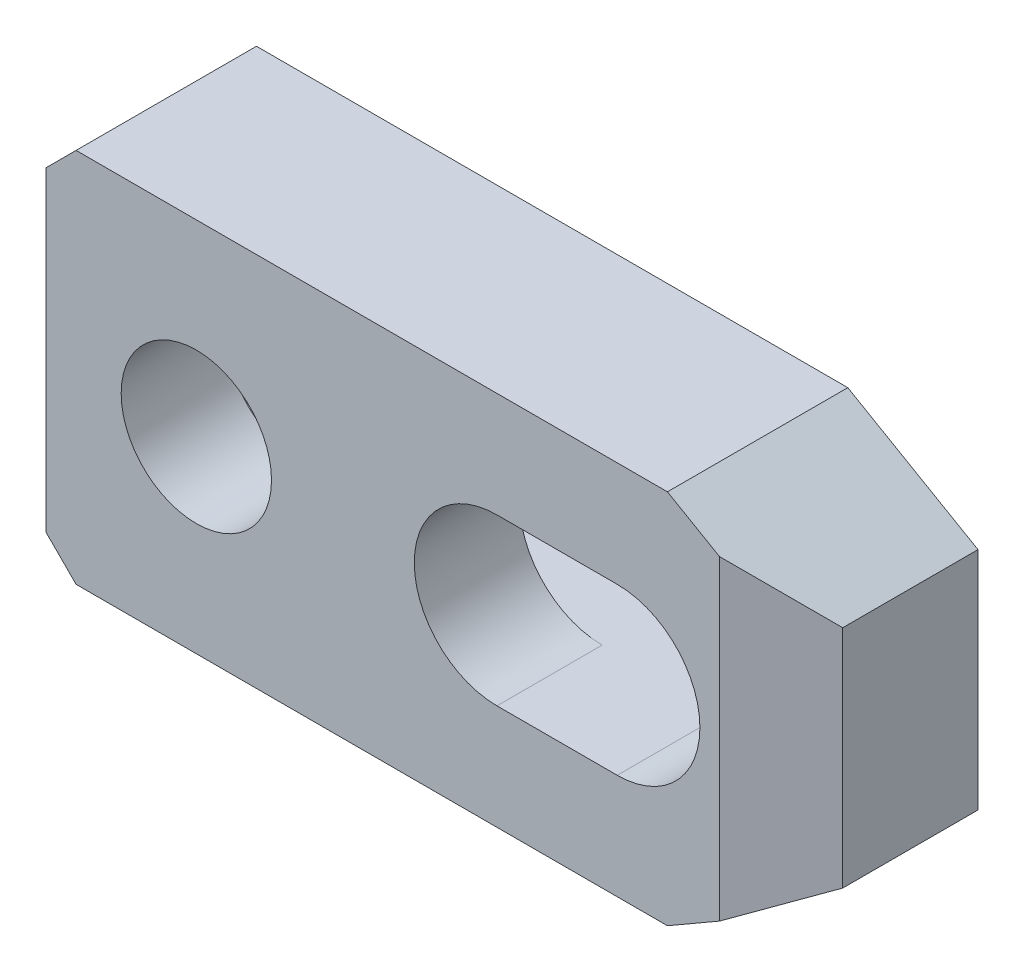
ISO-10303-21;
HEADER;
FILE_DESCRIPTION(('STEP AP214'),'2;1');
FILE_NAME('part.step','',(''),(''),'','','');
FILE_SCHEMA(('AUTOMOTIVE_DESIGN { 1 0 10303 214 1 1 1 1 }'));
ENDSEC;
DATA;
#1=APPLICATION_CONTEXT('core data for automotive mechanical design processes');
#2=APPLICATION_PROTOCOL_DEFINITION('international standard','automotive_design',2000,#1);
#3=PRODUCT_CONTEXT('',#1,'mechanical');
#4=PRODUCT('Part','Part','',(#3));
#5=PRODUCT_RELATED_PRODUCT_CATEGORY('part','',(#4));
#6=PRODUCT_DEFINITION_FORMATION('','',#4);
#7=PRODUCT_DEFINITION_CONTEXT('part definition',#1,'design');
#8=PRODUCT_DEFINITION('design','',#6,#7);
#9=PRODUCT_DEFINITION_SHAPE('','',#8);
#10=(LENGTH_UNIT() NAMED_UNIT(*) SI_UNIT(.MILLI.,.METRE.));
#11=(NAMED_UNIT(*) PLANE_ANGLE_UNIT() SI_UNIT($,.RADIAN.));
#12=(NAMED_UNIT(*) SI_UNIT($,.STERADIAN.) SOLID_ANGLE_UNIT());
#13=UNCERTAINTY_MEASURE_WITH_UNIT(LENGTH_MEASURE(1.E-05),#10,'distance_accuracy_value','');
#14=(GEOMETRIC_REPRESENTATION_CONTEXT(3) GLOBAL_UNCERTAINTY_ASSIGNED_CONTEXT((#13)) GLOBAL_UNIT_ASSIGNED_CONTEXT((#10,
#11,#12)) REPRESENTATION_CONTEXT('',''));
#15=CARTESIAN_POINT('',(0.,0.,0.));
#16=DIRECTION('',(0.,0.,1.));
#17=DIRECTION('',(1.,0.,0.));
#18=AXIS2_PLACEMENT_3D('',#15,#16,#17);
#19=CARTESIAN_POINT('',(-21.6006535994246,26.8993464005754,0.));
#20=DIRECTION('',(0.,0.,1.));
#21=DIRECTION('',(-1.,0.,0.));
#22=AXIS2_PLACEMENT_3D('',#19,#20,#21);
#23=PLANE('',#22);
#24=DIRECTION('',(0.,1.,0.));
#25=VECTOR('',#24,1.);
#26=CARTESIAN_POINT('',(-38.,-10.5,0.));
#27=LINE('',#26,#25);
#28=CARTESIAN_POINT('',(-38.,-10.5,0.));
#29=VERTEX_POINT('',#28);
#30=CARTESIAN_POINT('',(-38.,-5.5,0.));
#31=VERTEX_POINT('',#30);
#32=EDGE_CURVE('E174',#29,#31,#27,.T.);
#33=ORIENTED_EDGE('',*,*,#32,.T.);
#34=DIRECTION('',(-1.,0.,0.));
#35=VECTOR('',#34,1.);
#36=CARTESIAN_POINT('',(0.,-5.5,0.));
#37=LINE('',#36,#35);
#38=CARTESIAN_POINT('',(0.,-5.5,0.));
#39=VERTEX_POINT('',#38);
#40=EDGE_CURVE('E265',#39,#31,#37,.T.);
#41=ORIENTED_EDGE('',*,*,#40,.F.);
#42=CARTESIAN_POINT('',(0.,0.,0.));
#43=DIRECTION('',(0.,0.,1.));
#44=DIRECTION('',(-1.,0.,0.));
#45=AXIS2_PLACEMENT_3D('',#42,#43,#44);
#46=CIRCLE('',#45,5.5);
#47=CARTESIAN_POINT('',(0.,5.5,0.));
#48=VERTEX_POINT('',#47);
#49=EDGE_CURVE('E267',#39,#48,#46,.T.);
#50=ORIENTED_EDGE('',*,*,#49,.T.);
#51=DIRECTION('',(1.,0.,0.));
#52=VECTOR('',#51,1.);
#53=CARTESIAN_POINT('',(-8.,5.5,0.));
#54=LINE('',#53,#52);
#55=CARTESIAN_POINT('',(-38.,5.5,0.));
#56=VERTEX_POINT('',#55);
#57=EDGE_CURVE('E229',#56,#48,#54,.T.);
#58=ORIENTED_EDGE('',*,*,#57,.F.);
#59=CARTESIAN_POINT('',(-38.,10.5,0.));
#60=VERTEX_POINT('',#59);
#61=EDGE_CURVE('E177',#56,#60,#27,.T.);
#62=ORIENTED_EDGE('',*,*,#61,.T.);
#63=DIRECTION('',(-0.707106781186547,-0.707106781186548,0.));
#64=VECTOR('',#63,1.);
#65=CARTESIAN_POINT('',(-36.,12.5,0.));
#66=LINE('',#65,#64);
#67=CARTESIAN_POINT('',(-36.,12.5,0.));
#68=VERTEX_POINT('',#67);
#69=EDGE_CURVE('E178',#68,#60,#66,.T.);
#70=ORIENTED_EDGE('',*,*,#69,.F.);
#71=DIRECTION('',(-1.,0.,0.));
#72=VECTOR('',#71,1.);
#73=CARTESIAN_POINT('',(3.3397459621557,12.5,0.));
#74=LINE('',#73,#72);
#75=CARTESIAN_POINT('',(3.3397459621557,12.5,0.));
#76=VERTEX_POINT('',#75);
#77=EDGE_CURVE('E181',#76,#68,#74,.T.);
#78=ORIENTED_EDGE('',*,*,#77,.F.);
#79=DIRECTION('',(-0.866025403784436,0.5,0.));
#80=VECTOR('',#79,1.);
#81=CARTESIAN_POINT('',(12.,7.5,0.));
#82=LINE('',#81,#80);
#83=CARTESIAN_POINT('',(12.,7.5,0.));
#84=VERTEX_POINT('',#83);
#85=EDGE_CURVE('E160',#84,#76,#82,.T.);
#86=ORIENTED_EDGE('',*,*,#85,.F.);
#87=DIRECTION('',(0.,-1.,0.));
#88=VECTOR('',#87,1.);
#89=CARTESIAN_POINT('',(12.,7.5,0.));
#90=LINE('',#89,#88);
#91=CARTESIAN_POINT('',(12.,-7.5,0.));
#92=VERTEX_POINT('',#91);
#93=EDGE_CURVE('E161',#84,#92,#90,.T.);
#94=ORIENTED_EDGE('',*,*,#93,.T.);
#95=DIRECTION('',(-0.86602540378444,-0.5,0.));
#96=VECTOR('',#95,1.);
#97=CARTESIAN_POINT('',(12.,-7.5,0.));
#98=LINE('',#97,#96);
#99=CARTESIAN_POINT('',(3.33974596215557,-12.5,0.));
#100=VERTEX_POINT('',#99);
#101=EDGE_CURVE('E165',#92,#100,#98,.T.);
#102=ORIENTED_EDGE('',*,*,#101,.T.);
#103=DIRECTION('',(-1.,0.,0.));
#104=VECTOR('',#103,1.);
#105=CARTESIAN_POINT('',(3.33974596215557,-12.5,0.));
#106=LINE('',#105,#104);
#107=CARTESIAN_POINT('',(-36.,-12.5,0.));
#108=VERTEX_POINT('',#107);
#109=EDGE_CURVE('E168',#100,#108,#106,.T.);
#110=ORIENTED_EDGE('',*,*,#109,.T.);
#111=DIRECTION('',(-0.707106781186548,0.707106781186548,0.));
#112=VECTOR('',#111,1.);
#113=CARTESIAN_POINT('',(-36.,-12.5,0.));
#114=LINE('',#113,#112);
#115=EDGE_CURVE('E171',#108,#29,#114,.T.);
#116=ORIENTED_EDGE('',*,*,#115,.T.);
#117=EDGE_LOOP('',(#33,#41,#50,#58,#62,#70,#78,#86,#94,#102,#110,#116));
#118=FACE_BOUND('',#117,.T.);
#119=ADVANCED_FACE('F14',(#118),#23,.F.);
#120=CARTESIAN_POINT('',(-38.,-10.5,12.));
#121=DIRECTION('',(-1.,0.,0.));
#122=DIRECTION('',(0.,0.,-1.));
#123=AXIS2_PLACEMENT_3D('',#120,#121,#122);
#124=PLANE('',#123);
#125=DIRECTION('',(0.,-1.,0.));
#126=VECTOR('',#125,1.);
#127=CARTESIAN_POINT('',(-38.,-10.5,5.));
#128=LINE('',#127,#126);
#129=CARTESIAN_POINT('',(-38.,5.5,5.));
#130=VERTEX_POINT('',#129);
#131=CARTESIAN_POINT('',(-38.,-5.5,5.));
#132=VERTEX_POINT('',#131);
#133=EDGE_CURVE('E126',#130,#132,#128,.T.);
#134=ORIENTED_EDGE('',*,*,#133,.T.);
#135=DIRECTION('',(0.,0.,-1.));
#136=VECTOR('',#135,1.);
#137=CARTESIAN_POINT('',(-38.,-5.5,12.));
#138=LINE('',#137,#136);
#139=EDGE_CURVE('E263',#132,#31,#138,.T.);
#140=ORIENTED_EDGE('',*,*,#139,.T.);
#141=ORIENTED_EDGE('',*,*,#32,.F.);
#142=DIRECTION('',(0.,0.,-1.));
#143=VECTOR('',#142,1.);
#144=CARTESIAN_POINT('',(-38.,-10.5,12.));
#145=LINE('',#144,#143);
#146=CARTESIAN_POINT('',(-38.,-10.5,12.));
#147=VERTEX_POINT('',#146);
#148=EDGE_CURVE('E212',#147,#29,#145,.T.);
#149=ORIENTED_EDGE('',*,*,#148,.F.);
#150=DIRECTION('',(0.,1.,0.));
#151=VECTOR('',#150,1.);
#152=CARTESIAN_POINT('',(-38.,-10.5,12.));
#153=LINE('',#152,#151);
#154=CARTESIAN_POINT('',(-38.,10.5,12.));
#155=VERTEX_POINT('',#154);
#156=EDGE_CURVE('E195',#147,#155,#153,.T.);
#157=ORIENTED_EDGE('',*,*,#156,.T.);
#158=DIRECTION('',(0.,0.,-1.));
#159=VECTOR('',#158,1.);
#160=CARTESIAN_POINT('',(-38.,10.5,12.));
#161=LINE('',#160,#159);
#162=EDGE_CURVE('E214',#155,#60,#161,.T.);
#163=ORIENTED_EDGE('',*,*,#162,.T.);
#164=ORIENTED_EDGE('',*,*,#61,.F.);
#165=DIRECTION('',(0.,0.,-1.));
#166=VECTOR('',#165,1.);
#167=CARTESIAN_POINT('',(-38.,5.5,12.));
#168=LINE('',#167,#166);
#169=EDGE_CURVE('E284',#130,#56,#168,.T.);
#170=ORIENTED_EDGE('',*,*,#169,.F.);
#171=EDGE_LOOP('',(#134,#140,#141,#149,#157,#163,#164,#170));
#172=FACE_BOUND('',#171,.T.);
#173=ADVANCED_FACE('F231',(#172),#124,.T.);
#174=CARTESIAN_POINT('',(-28.,0.,12.));
#175=DIRECTION('',(0.,0.,-1.));
#176=DIRECTION('',(1.,0.,0.));
#177=AXIS2_PLACEMENT_3D('',#174,#175,#176);
#178=CYLINDRICAL_SURFACE('',#177,5.);
#179=CARTESIAN_POINT('',(-28.,0.,12.));
#180=DIRECTION('',(0.,0.,1.));
#181=DIRECTION('',(-1.,0.,0.));
#182=AXIS2_PLACEMENT_3D('',#179,#180,#181);
#183=CIRCLE('',#182,5.);
#184=CARTESIAN_POINT('',(-33.,0.,12.));
#185=VERTEX_POINT('',#184);
#186=EDGE_CURVE('E157',#185,#185,#183,.T.);
#187=ORIENTED_EDGE('',*,*,#186,.T.);
#188=EDGE_LOOP('',(#187));
#189=FACE_BOUND('',#188,.T.);
#190=CARTESIAN_POINT('',(-28.,0.,5.));
#191=DIRECTION('',(0.,0.,-1.));
#192=DIRECTION('',(1.,0.,0.));
#193=AXIS2_PLACEMENT_3D('',#190,#191,#192);
#194=CIRCLE('',#193,5.);
#195=CARTESIAN_POINT('',(-23.,0.,5.));
#196=VERTEX_POINT('',#195);
#197=EDGE_CURVE('E140',#196,#196,#194,.T.);
#198=ORIENTED_EDGE('',*,*,#197,.T.);
#199=EDGE_LOOP('',(#198));
#200=FACE_BOUND('',#199,.T.);
#201=ADVANCED_FACE('F298',(#189,#200),#178,.F.);
#202=CARTESIAN_POINT('',(-8.,0.,12.));
#203=DIRECTION('',(0.,0.,-1.));
#204=DIRECTION('',(1.,0.,0.));
#205=AXIS2_PLACEMENT_3D('',#202,#203,#204);
#206=CYLINDRICAL_SURFACE('',#205,5.5);
#207=DIRECTION('',(0.,0.,-1.));
#208=VECTOR('',#207,1.);
#209=CARTESIAN_POINT('',(-8.,-5.5,12.));
#210=LINE('',#209,#208);
#211=CARTESIAN_POINT('',(-8.,-5.5,12.));
#212=VERTEX_POINT('',#211);
#213=CARTESIAN_POINT('',(-8.,-5.5,5.));
#214=VERTEX_POINT('',#213);
#215=EDGE_CURVE('E139',#212,#214,#210,.T.);
#216=ORIENTED_EDGE('',*,*,#215,.T.);
#217=CARTESIAN_POINT('',(-8.,0.,5.));
#218=DIRECTION('',(0.,0.,-1.));
#219=DIRECTION('',(1.,0.,0.));
#220=AXIS2_PLACEMENT_3D('',#217,#218,#219);
#221=CIRCLE('',#220,5.5);
#222=CARTESIAN_POINT('',(-8.,5.5,5.));
#223=VERTEX_POINT('',#222);
#224=EDGE_CURVE('E123',#214,#223,#221,.T.);
#225=ORIENTED_EDGE('',*,*,#224,.T.);
#226=DIRECTION('',(0.,0.,-1.));
#227=VECTOR('',#226,1.);
#228=CARTESIAN_POINT('',(-8.,5.5,12.));
#229=LINE('',#228,#227);
#230=CARTESIAN_POINT('',(-8.,5.5,12.));
#231=VERTEX_POINT('',#230);
#232=EDGE_CURVE('E137',#231,#223,#229,.T.);
#233=ORIENTED_EDGE('',*,*,#232,.F.);
#234=CARTESIAN_POINT('',(-8.,0.,12.));
#235=DIRECTION('',(0.,0.,1.));
#236=DIRECTION('',(-1.,0.,0.));
#237=AXIS2_PLACEMENT_3D('',#234,#235,#236);
#238=CIRCLE('',#237,5.5);
#239=EDGE_CURVE('E152',#231,#212,#238,.T.);
#240=ORIENTED_EDGE('',*,*,#239,.T.);
#241=EDGE_LOOP('',(#216,#225,#233,#240));
#242=FACE_BOUND('',#241,.T.);
#243=ADVANCED_FACE('F135',(#242),#206,.F.);
#244=CARTESIAN_POINT('',(-21.6006535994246,26.8993464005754,12.));
#245=DIRECTION('',(0.,0.,1.));
#246=DIRECTION('',(-1.,0.,0.));
#247=AXIS2_PLACEMENT_3D('',#244,#245,#246);
#248=PLANE('',#247);
#249=DIRECTION('',(0.,-1.,0.));
#250=VECTOR('',#249,1.);
#251=CARTESIAN_POINT('',(6.80384757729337,26.8993464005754,12.));
#252=LINE('',#251,#250);
#253=CARTESIAN_POINT('',(6.80384757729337,10.5,12.));
#254=VERTEX_POINT('',#253);
#255=CARTESIAN_POINT('',(6.80384757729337,-10.5,12.));
#256=VERTEX_POINT('',#255);
#257=EDGE_CURVE('E240',#254,#256,#252,.T.);
#258=ORIENTED_EDGE('',*,*,#257,.F.);
#259=DIRECTION('',(-0.866025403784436,0.5,0.));
#260=VECTOR('',#259,1.);
#261=CARTESIAN_POINT('',(12.,7.5,12.));
#262=LINE('',#261,#260);
#263=CARTESIAN_POINT('',(3.3397459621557,12.5,12.));
#264=VERTEX_POINT('',#263);
#265=EDGE_CURVE('E164',#254,#264,#262,.T.);
#266=ORIENTED_EDGE('',*,*,#265,.T.);
#267=DIRECTION('',(-1.,0.,0.));
#268=VECTOR('',#267,1.);
#269=CARTESIAN_POINT('',(3.3397459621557,12.5,12.));
#270=LINE('',#269,#268);
#271=CARTESIAN_POINT('',(-36.,12.5,12.));
#272=VERTEX_POINT('',#271);
#273=EDGE_CURVE('E201',#264,#272,#270,.T.);
#274=ORIENTED_EDGE('',*,*,#273,.T.);
#275=DIRECTION('',(-0.707106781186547,-0.707106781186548,0.));
#276=VECTOR('',#275,1.);
#277=CARTESIAN_POINT('',(-36.,12.5,12.));
#278=LINE('',#277,#276);
#279=EDGE_CURVE('E198',#272,#155,#278,.T.);
#280=ORIENTED_EDGE('',*,*,#279,.T.);
#281=ORIENTED_EDGE('',*,*,#156,.F.);
#282=DIRECTION('',(-0.707106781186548,0.707106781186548,0.));
#283=VECTOR('',#282,1.);
#284=CARTESIAN_POINT('',(-36.,-12.5,12.));
#285=LINE('',#284,#283);
#286=CARTESIAN_POINT('',(-36.,-12.5,12.));
#287=VERTEX_POINT('',#286);
#288=EDGE_CURVE('E192',#287,#147,#285,.T.);
#289=ORIENTED_EDGE('',*,*,#288,.F.);
#290=DIRECTION('',(-1.,0.,0.));
#291=VECTOR('',#290,1.);
#292=CARTESIAN_POINT('',(3.33974596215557,-12.5,12.));
#293=LINE('',#292,#291);
#294=CARTESIAN_POINT('',(3.33974596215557,-12.5,12.));
#295=VERTEX_POINT('',#294);
#296=EDGE_CURVE('E189',#295,#287,#293,.T.);
#297=ORIENTED_EDGE('',*,*,#296,.F.);
#298=DIRECTION('',(-0.86602540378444,-0.5,0.));
#299=VECTOR('',#298,1.);
#300=CARTESIAN_POINT('',(12.,-7.5,12.));
#301=LINE('',#300,#299);
#302=EDGE_CURVE('E186',#256,#295,#301,.T.);
#303=ORIENTED_EDGE('',*,*,#302,.F.);
#304=EDGE_LOOP('',(#258,#266,#274,#280,#281,#289,#297,#303));
#305=FACE_BOUND('',#304,.T.);
#306=ORIENTED_EDGE('',*,*,#186,.F.);
#307=EDGE_LOOP('',(#306));
#308=FACE_BOUND('',#307,.T.);
#309=DIRECTION('',(-1.,0.,0.));
#310=VECTOR('',#309,1.);
#311=CARTESIAN_POINT('',(0.,-5.5,12.));
#312=LINE('',#311,#310);
#313=CARTESIAN_POINT('',(0.,-5.5,12.));
#314=VERTEX_POINT('',#313);
#315=EDGE_CURVE('E275',#314,#212,#312,.T.);
#316=ORIENTED_EDGE('',*,*,#315,.T.);
#317=ORIENTED_EDGE('',*,*,#239,.F.);
#318=DIRECTION('',(1.,0.,0.));
#319=VECTOR('',#318,1.);
#320=CARTESIAN_POINT('',(-8.,5.5,12.));
#321=LINE('',#320,#319);
#322=CARTESIAN_POINT('',(0.,5.5,12.));
#323=VERTEX_POINT('',#322);
#324=EDGE_CURVE('E144',#231,#323,#321,.T.);
#325=ORIENTED_EDGE('',*,*,#324,.T.);
#326=CARTESIAN_POINT('',(0.,0.,12.));
#327=DIRECTION('',(0.,0.,1.));
#328=DIRECTION('',(-1.,0.,0.));
#329=AXIS2_PLACEMENT_3D('',#326,#327,#328);
#330=CIRCLE('',#329,5.5);
#331=EDGE_CURVE('E37',#314,#323,#330,.T.);
#332=ORIENTED_EDGE('',*,*,#331,.F.);
#333=EDGE_LOOP('',(#316,#317,#325,#332));
#334=FACE_BOUND('',#333,.T.);
#335=ADVANCED_FACE('F235',(#305,#308,#334),#248,.T.);
#336=CARTESIAN_POINT('',(12.,7.5,12.));
#337=DIRECTION('',(-0.5,-0.866025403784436,0.));
#338=DIRECTION('',(0.866025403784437,-0.5,0.));
#339=AXIS2_PLACEMENT_3D('',#336,#337,#338);
#340=PLANE('',#339);
#341=ORIENTED_EDGE('',*,*,#265,.F.);
#342=DIRECTION('',(0.774596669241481,-0.447213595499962,-0.447213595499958));
#343=VECTOR('',#342,1.);
#344=CARTESIAN_POINT('',(10.9607695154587,8.1,9.6));
#345=LINE('',#344,#343);
#346=CARTESIAN_POINT('',(12.,7.5,9.));
#347=VERTEX_POINT('',#346);
#348=EDGE_CURVE('E269',#254,#347,#345,.T.);
#349=ORIENTED_EDGE('',*,*,#348,.T.);
#350=DIRECTION('',(0.,0.,-1.));
#351=VECTOR('',#350,1.);
#352=CARTESIAN_POINT('',(12.,7.5,12.));
#353=LINE('',#352,#351);
#354=EDGE_CURVE('E188',#347,#84,#353,.T.);
#355=ORIENTED_EDGE('',*,*,#354,.T.);
#356=ORIENTED_EDGE('',*,*,#85,.T.);
#357=DIRECTION('',(0.,0.,-1.));
#358=VECTOR('',#357,1.);
#359=CARTESIAN_POINT('',(3.3397459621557,12.5,12.));
#360=LINE('',#359,#358);
#361=EDGE_CURVE('E9',#264,#76,#360,.T.);
#362=ORIENTED_EDGE('',*,*,#361,.F.);
#363=EDGE_LOOP('',(#341,#349,#355,#356,#362));
#364=FACE_BOUND('',#363,.T.);
#365=ADVANCED_FACE('F243',(#364),#340,.F.);
#366=CARTESIAN_POINT('',(3.3397459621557,12.5,12.));
#367=DIRECTION('',(0.,-1.,0.));
#368=DIRECTION('',(0.,0.,1.));
#369=AXIS2_PLACEMENT_3D('',#366,#367,#368);
#370=PLANE('',#369);
#371=DIRECTION('',(0.,0.,-1.));
#372=VECTOR('',#371,1.);
#373=CARTESIAN_POINT('',(-36.,12.5,12.));
#374=LINE('',#373,#372);
#375=EDGE_CURVE('E22',#272,#68,#374,.T.);
#376=ORIENTED_EDGE('',*,*,#375,.F.);
#377=ORIENTED_EDGE('',*,*,#273,.F.);
#378=ORIENTED_EDGE('',*,*,#361,.T.);
#379=ORIENTED_EDGE('',*,*,#77,.T.);
#380=EDGE_LOOP('',(#376,#377,#378,#379));
#381=FACE_BOUND('',#380,.T.);
#382=ADVANCED_FACE('F16',(#381),#370,.F.);
#383=CARTESIAN_POINT('',(-36.,12.5,12.));
#384=DIRECTION('',(0.707106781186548,-0.707106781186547,0.));
#385=DIRECTION('',(0.707106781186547,0.707106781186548,0.));
#386=AXIS2_PLACEMENT_3D('',#383,#384,#385);
#387=PLANE('',#386);
#388=ORIENTED_EDGE('',*,*,#162,.F.);
#389=ORIENTED_EDGE('',*,*,#279,.F.);
#390=ORIENTED_EDGE('',*,*,#375,.T.);
#391=ORIENTED_EDGE('',*,*,#69,.T.);
#392=EDGE_LOOP('',(#388,#389,#390,#391));
#393=FACE_BOUND('',#392,.T.);
#394=ADVANCED_FACE('F218',(#393),#387,.F.);
#395=CARTESIAN_POINT('',(-36.,-12.5,12.));
#396=DIRECTION('',(-0.707106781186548,-0.707106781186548,0.));
#397=DIRECTION('',(0.707106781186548,-0.707106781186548,0.));
#398=AXIS2_PLACEMENT_3D('',#395,#396,#397);
#399=PLANE('',#398);
#400=DIRECTION('',(0.,0.,-1.));
#401=VECTOR('',#400,1.);
#402=CARTESIAN_POINT('',(-36.,-12.5,12.));
#403=LINE('',#402,#401);
#404=EDGE_CURVE('E210',#287,#108,#403,.T.);
#405=ORIENTED_EDGE('',*,*,#404,.F.);
#406=ORIENTED_EDGE('',*,*,#288,.T.);
#407=ORIENTED_EDGE('',*,*,#148,.T.);
#408=ORIENTED_EDGE('',*,*,#115,.F.);
#409=EDGE_LOOP('',(#405,#406,#407,#408));
#410=FACE_BOUND('',#409,.T.);
#411=ADVANCED_FACE('F260',(#410),#399,.T.);
#412=CARTESIAN_POINT('',(3.33974596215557,-12.5,12.));
#413=DIRECTION('',(0.,-1.,0.));
#414=DIRECTION('',(0.,0.,1.));
#415=AXIS2_PLACEMENT_3D('',#412,#413,#414);
#416=PLANE('',#415);
#417=DIRECTION('',(0.,0.,-1.));
#418=VECTOR('',#417,1.);
#419=CARTESIAN_POINT('',(3.33974596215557,-12.5,12.));
#420=LINE('',#419,#418);
#421=EDGE_CURVE('E208',#295,#100,#420,.T.);
#422=ORIENTED_EDGE('',*,*,#421,.F.);
#423=ORIENTED_EDGE('',*,*,#296,.T.);
#424=ORIENTED_EDGE('',*,*,#404,.T.);
#425=ORIENTED_EDGE('',*,*,#109,.F.);
#426=EDGE_LOOP('',(#422,#423,#424,#425));
#427=FACE_BOUND('',#426,.T.);
#428=ADVANCED_FACE('F257',(#427),#416,.T.);
#429=CARTESIAN_POINT('',(12.,-7.5,12.));
#430=DIRECTION('',(0.5,-0.86602540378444,0.));
#431=DIRECTION('',(0.86602540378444,0.5,0.));
#432=AXIS2_PLACEMENT_3D('',#429,#430,#431);
#433=PLANE('',#432);
#434=DIRECTION('',(0.774596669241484,0.447213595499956,-0.44721359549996));
#435=VECTOR('',#434,1.);
#436=CARTESIAN_POINT('',(10.9607695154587,-8.1,9.6));
#437=LINE('',#436,#435);
#438=CARTESIAN_POINT('',(12.,-7.5,9.));
#439=VERTEX_POINT('',#438);
#440=EDGE_CURVE('E29',#256,#439,#437,.T.);
#441=ORIENTED_EDGE('',*,*,#440,.F.);
#442=ORIENTED_EDGE('',*,*,#302,.T.);
#443=ORIENTED_EDGE('',*,*,#421,.T.);
#444=ORIENTED_EDGE('',*,*,#101,.F.);
#445=DIRECTION('',(0.,0.,-1.));
#446=VECTOR('',#445,1.);
#447=CARTESIAN_POINT('',(12.,-7.5,12.));
#448=LINE('',#447,#446);
#449=EDGE_CURVE('E206',#439,#92,#448,.T.);
#450=ORIENTED_EDGE('',*,*,#449,.F.);
#451=EDGE_LOOP('',(#441,#442,#443,#444,#450));
#452=FACE_BOUND('',#451,.T.);
#453=ADVANCED_FACE('F252',(#452),#433,.T.);
#454=CARTESIAN_POINT('',(12.,7.5,12.));
#455=DIRECTION('',(1.,0.,0.));
#456=DIRECTION('',(0.,0.,1.));
#457=AXIS2_PLACEMENT_3D('',#454,#455,#456);
#458=PLANE('',#457);
#459=DIRECTION('',(0.,-1.,0.));
#460=VECTOR('',#459,1.);
#461=CARTESIAN_POINT('',(12.,20.,9.));
#462=LINE('',#461,#460);
#463=EDGE_CURVE('E250',#347,#439,#462,.T.);
#464=ORIENTED_EDGE('',*,*,#463,.T.);
#465=ORIENTED_EDGE('',*,*,#449,.T.);
#466=ORIENTED_EDGE('',*,*,#93,.F.);
#467=ORIENTED_EDGE('',*,*,#354,.F.);
#468=EDGE_LOOP('',(#464,#465,#466,#467));
#469=FACE_BOUND('',#468,.T.);
#470=ADVANCED_FACE('F247',(#469),#458,.T.);
#471=CARTESIAN_POINT('',(0.,-5.5,12.));
#472=DIRECTION('',(0.,-1.,0.));
#473=DIRECTION('',(1.,0.,0.));
#474=AXIS2_PLACEMENT_3D('',#471,#472,#473);
#475=PLANE('',#474);
#476=DIRECTION('',(0.,0.,-1.));
#477=VECTOR('',#476,1.);
#478=CARTESIAN_POINT('',(0.,-5.5,12.));
#479=LINE('',#478,#477);
#480=EDGE_CURVE('E148',#314,#39,#479,.T.);
#481=ORIENTED_EDGE('',*,*,#480,.T.);
#482=ORIENTED_EDGE('',*,*,#40,.T.);
#483=ORIENTED_EDGE('',*,*,#139,.F.);
#484=DIRECTION('',(1.,0.,0.));
#485=VECTOR('',#484,1.);
#486=CARTESIAN_POINT('',(-58.,-5.5,5.));
#487=LINE('',#486,#485);
#488=EDGE_CURVE('E131',#132,#214,#487,.T.);
#489=ORIENTED_EDGE('',*,*,#488,.T.);
#490=ORIENTED_EDGE('',*,*,#215,.F.);
#491=ORIENTED_EDGE('',*,*,#315,.F.);
#492=EDGE_LOOP('',(#481,#482,#483,#489,#490,#491));
#493=FACE_BOUND('',#492,.T.);
#494=ADVANCED_FACE('F289',(#493),#475,.F.);
#495=CARTESIAN_POINT('',(0.,0.,12.));
#496=DIRECTION('',(0.,0.,-1.));
#497=DIRECTION('',(1.,0.,0.));
#498=AXIS2_PLACEMENT_3D('',#495,#496,#497);
#499=CYLINDRICAL_SURFACE('',#498,5.5);
#500=DIRECTION('',(0.,0.,-1.));
#501=VECTOR('',#500,1.);
#502=CARTESIAN_POINT('',(0.,5.5,12.));
#503=LINE('',#502,#501);
#504=EDGE_CURVE('E146',#323,#48,#503,.T.);
#505=ORIENTED_EDGE('',*,*,#504,.T.);
#506=ORIENTED_EDGE('',*,*,#49,.F.);
#507=ORIENTED_EDGE('',*,*,#480,.F.);
#508=ORIENTED_EDGE('',*,*,#331,.T.);
#509=EDGE_LOOP('',(#505,#506,#507,#508));
#510=FACE_BOUND('',#509,.T.);
#511=ADVANCED_FACE('F312',(#510),#499,.F.);
#512=CARTESIAN_POINT('',(-8.,5.5,12.));
#513=DIRECTION('',(0.,1.,0.));
#514=DIRECTION('',(-1.,0.,0.));
#515=AXIS2_PLACEMENT_3D('',#512,#513,#514);
#516=PLANE('',#515);
#517=ORIENTED_EDGE('',*,*,#324,.F.);
#518=ORIENTED_EDGE('',*,*,#232,.T.);
#519=DIRECTION('',(1.,0.,0.));
#520=VECTOR('',#519,1.);
#521=CARTESIAN_POINT('',(-58.,5.5,5.));
#522=LINE('',#521,#520);
#523=EDGE_CURVE('E119',#130,#223,#522,.T.);
#524=ORIENTED_EDGE('',*,*,#523,.F.);
#525=ORIENTED_EDGE('',*,*,#169,.T.);
#526=ORIENTED_EDGE('',*,*,#57,.T.);
#527=ORIENTED_EDGE('',*,*,#504,.F.);
#528=EDGE_LOOP('',(#517,#518,#524,#525,#526,#527));
#529=FACE_BOUND('',#528,.T.);
#530=ADVANCED_FACE('F142',(#529),#516,.F.);
#531=CARTESIAN_POINT('',(-0.124355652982,20.,16.));
#532=DIRECTION('',(-0.5,0.,-0.866025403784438));
#533=DIRECTION('',(0.866025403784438,0.,-0.5));
#534=AXIS2_PLACEMENT_3D('',#531,#532,#533);
#535=PLANE('',#534);
#536=ORIENTED_EDGE('',*,*,#257,.T.);
#537=ORIENTED_EDGE('',*,*,#440,.T.);
#538=ORIENTED_EDGE('',*,*,#463,.F.);
#539=ORIENTED_EDGE('',*,*,#348,.F.);
#540=EDGE_LOOP('',(#536,#537,#538,#539));
#541=FACE_BOUND('',#540,.T.);
#542=ADVANCED_FACE('F316',(#541),#535,.F.);
#543=CARTESIAN_POINT('',(-58.,5.5,5.));
#544=DIRECTION('',(0.,0.,-1.));
#545=DIRECTION('',(1.,0.,0.));
#546=AXIS2_PLACEMENT_3D('',#543,#544,#545);
#547=PLANE('',#546);
#548=ORIENTED_EDGE('',*,*,#197,.F.);
#549=EDGE_LOOP('',(#548));
#550=FACE_BOUND('',#549,.T.);
#551=ORIENTED_EDGE('',*,*,#523,.T.);
#552=ORIENTED_EDGE('',*,*,#224,.F.);
#553=ORIENTED_EDGE('',*,*,#488,.F.);
#554=ORIENTED_EDGE('',*,*,#133,.F.);
#555=EDGE_LOOP('',(#551,#552,#553,#554));
#556=FACE_BOUND('',#555,.T.);
#557=ADVANCED_FACE('F121',(#550,#556),#547,.T.);
#558=CLOSED_SHELL('',(#119,#173,#201,#243,#335,#365,#382,#394,#411,#428,#453,#470,#494,#511,
#530,#542,#557));
#559=MANIFOLD_SOLID_BREP('B1',#558);
#560=ADVANCED_BREP_SHAPE_REPRESENTATION('',(#18,#559),#14);
#561=SHAPE_DEFINITION_REPRESENTATION(#9,#560);
ENDSEC;
END-ISO-10303-21;
